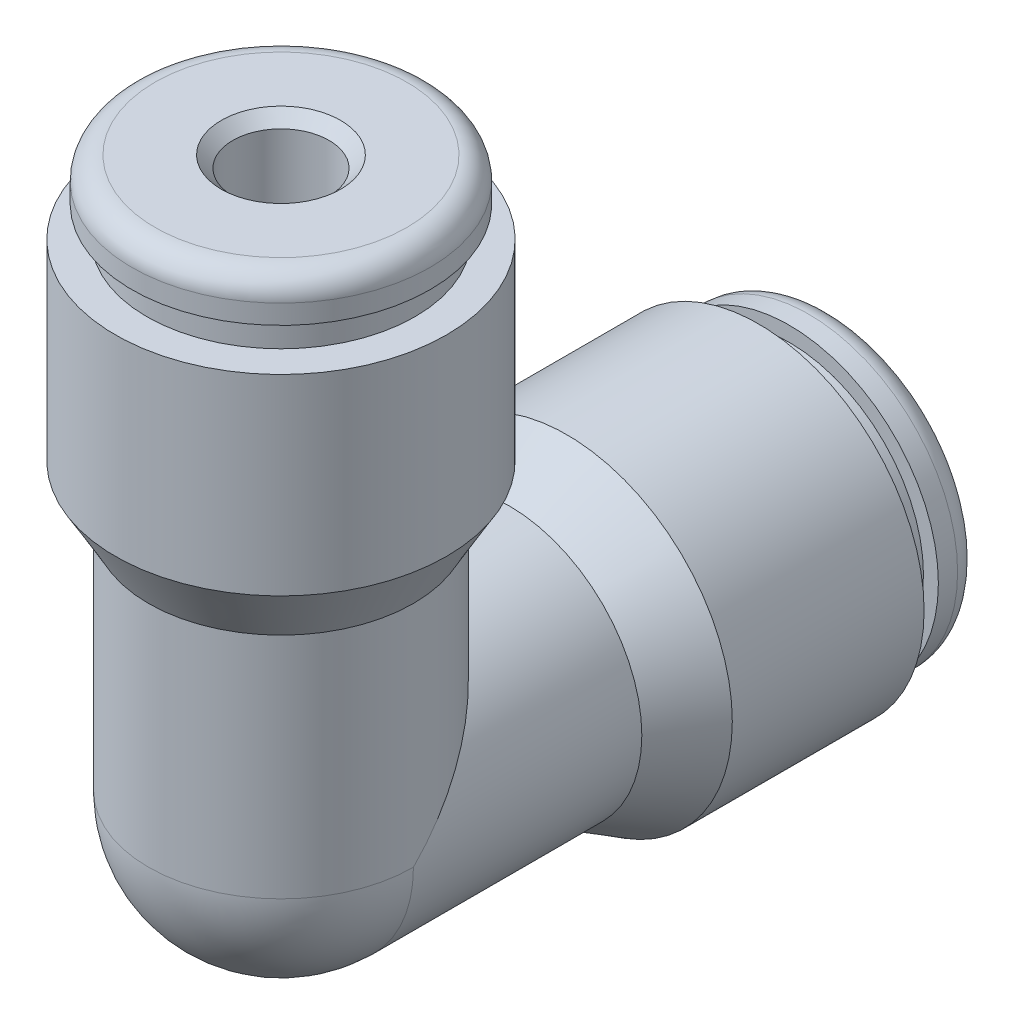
ISO-10303-21;
HEADER;
FILE_DESCRIPTION(('STEP AP214'),'2;1');
FILE_NAME('part.step','',(''),(''),'','','');
FILE_SCHEMA(('AUTOMOTIVE_DESIGN { 1 0 10303 214 1 1 1 1 }'));
ENDSEC;
DATA;
#1=APPLICATION_CONTEXT('core data for automotive mechanical design processes');
#2=APPLICATION_PROTOCOL_DEFINITION('international standard','automotive_design',2000,#1);
#3=PRODUCT_CONTEXT('',#1,'mechanical');
#4=PRODUCT('Part','Part','',(#3));
#5=PRODUCT_RELATED_PRODUCT_CATEGORY('part','',(#4));
#6=PRODUCT_DEFINITION_FORMATION('','',#4);
#7=PRODUCT_DEFINITION_CONTEXT('part definition',#1,'design');
#8=PRODUCT_DEFINITION('design','',#6,#7);
#9=PRODUCT_DEFINITION_SHAPE('','',#8);
#10=(LENGTH_UNIT() NAMED_UNIT(*) SI_UNIT(.MILLI.,.METRE.));
#11=(NAMED_UNIT(*) PLANE_ANGLE_UNIT() SI_UNIT($,.RADIAN.));
#12=(NAMED_UNIT(*) SI_UNIT($,.STERADIAN.) SOLID_ANGLE_UNIT());
#13=UNCERTAINTY_MEASURE_WITH_UNIT(LENGTH_MEASURE(1.E-05),#10,'distance_accuracy_value','');
#14=(GEOMETRIC_REPRESENTATION_CONTEXT(3) GLOBAL_UNCERTAINTY_ASSIGNED_CONTEXT((#13)) GLOBAL_UNIT_ASSIGNED_CONTEXT((#10,
#11,#12)) REPRESENTATION_CONTEXT('',''));
#15=CARTESIAN_POINT('',(0.,0.,0.));
#16=DIRECTION('',(0.,0.,1.));
#17=DIRECTION('',(1.,0.,0.));
#18=AXIS2_PLACEMENT_3D('',#15,#16,#17);
#19=CARTESIAN_POINT('',(0.,18.161,0.));
#20=DIRECTION('',(0.,-1.,0.));
#21=DIRECTION('',(0.,0.,-1.));
#22=AXIS2_PLACEMENT_3D('',#19,#20,#21);
#23=CYLINDRICAL_SURFACE('',#22,2.413);
#24=CARTESIAN_POINT('',(0.,0.,0.));
#25=DIRECTION('',(0.,-1.,0.));
#26=DIRECTION('',(1.,0.,0.));
#27=AXIS2_PLACEMENT_3D('',#24,#25,#26);
#28=CIRCLE('',#27,2.413);
#29=CARTESIAN_POINT('',(2.413,0.,0.));
#30=VERTEX_POINT('',#29);
#31=CARTESIAN_POINT('',(-2.413,0.,0.));
#32=VERTEX_POINT('',#31);
#33=EDGE_CURVE('E72',#30,#32,#28,.T.);
#34=ORIENTED_EDGE('',*,*,#33,.T.);
#35=CARTESIAN_POINT('',(0.,0.,0.));
#36=DIRECTION('',(0.,0.707106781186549,-0.707106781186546));
#37=DIRECTION('',(0.,0.707106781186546,0.707106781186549));
#38=AXIS2_PLACEMENT_3D('',#35,#36,#37);
#39=ELLIPSE('',#38,3.41249732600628,2.413);
#40=EDGE_CURVE('E67',#30,#32,#39,.F.);
#41=ORIENTED_EDGE('',*,*,#40,.F.);
#42=EDGE_LOOP('',(#34,#41));
#43=FACE_BOUND('',#42,.T.);
#44=ADVANCED_FACE('F36',(#43),#23,.F.);
#45=CARTESIAN_POINT('',(0.,0.,0.));
#46=DIRECTION('',(0.,0.,1.));
#47=DIRECTION('',(1.,0.,0.));
#48=AXIS2_PLACEMENT_3D('',#45,#46,#47);
#49=CYLINDRICAL_SURFACE('',#48,4.3688);
#50=CARTESIAN_POINT('',(0.,0.,-7.5311));
#51=DIRECTION('',(0.,0.,1.));
#52=DIRECTION('',(1.,0.,0.));
#53=AXIS2_PLACEMENT_3D('',#50,#51,#52);
#54=CIRCLE('',#53,4.3688);
#55=CARTESIAN_POINT('',(4.3688,0.,-7.5311));
#56=VERTEX_POINT('',#55);
#57=EDGE_CURVE('E145',#56,#56,#54,.T.);
#58=ORIENTED_EDGE('',*,*,#57,.T.);
#59=EDGE_LOOP('',(#58));
#60=FACE_BOUND('',#59,.T.);
#61=CARTESIAN_POINT('',(0.,0.,0.));
#62=DIRECTION('',(0.,0.707106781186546,0.707106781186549));
#63=DIRECTION('',(0.,-0.707106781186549,0.707106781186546));
#64=AXIS2_PLACEMENT_3D('',#61,#62,#63);
#65=ELLIPSE('',#64,6.17841621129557,4.3688);
#66=CARTESIAN_POINT('',(4.3688,0.,0.));
#67=VERTEX_POINT('',#66);
#68=CARTESIAN_POINT('',(-4.3688,0.,0.));
#69=VERTEX_POINT('',#68);
#70=EDGE_CURVE('E111',#67,#69,#65,.T.);
#71=ORIENTED_EDGE('',*,*,#70,.F.);
#72=CARTESIAN_POINT('',(0.,0.,0.));
#73=DIRECTION('',(0.,0.,1.));
#74=DIRECTION('',(1.,0.,0.));
#75=AXIS2_PLACEMENT_3D('',#72,#73,#74);
#76=CIRCLE('',#75,4.3688);
#77=EDGE_CURVE('E53',#69,#67,#76,.T.);
#78=ORIENTED_EDGE('',*,*,#77,.F.);
#79=EDGE_LOOP('',(#71,#78));
#80=FACE_BOUND('',#79,.T.);
#81=ADVANCED_FACE('F167',(#60,#80),#49,.T.);
#82=CARTESIAN_POINT('',(0.,0.,-4.3688));
#83=DIRECTION('',(0.,0.,1.));
#84=DIRECTION('',(1.,0.,0.));
#85=AXIS2_PLACEMENT_3D('',#82,#83,#84);
#86=CYLINDRICAL_SURFACE('',#85,2.413);
#87=CARTESIAN_POINT('',(0.,0.,0.));
#88=DIRECTION('',(0.,0.,1.));
#89=DIRECTION('',(1.,0.,0.));
#90=AXIS2_PLACEMENT_3D('',#87,#88,#89);
#91=CIRCLE('',#90,2.413);
#92=EDGE_CURVE('E62',#32,#30,#91,.T.);
#93=ORIENTED_EDGE('',*,*,#92,.T.);
#94=ORIENTED_EDGE('',*,*,#40,.T.);
#95=EDGE_LOOP('',(#93,#94));
#96=FACE_BOUND('',#95,.T.);
#97=CARTESIAN_POINT('',(0.,0.,-4.3688));
#98=DIRECTION('',(0.,0.,1.));
#99=DIRECTION('',(1.,0.,0.));
#100=AXIS2_PLACEMENT_3D('',#97,#98,#99);
#101=CIRCLE('',#100,2.413);
#102=CARTESIAN_POINT('',(2.413,0.,-4.3688));
#103=VERTEX_POINT('',#102);
#104=EDGE_CURVE('E70',#103,#103,#101,.T.);
#105=ORIENTED_EDGE('',*,*,#104,.F.);
#106=EDGE_LOOP('',(#105));
#107=FACE_BOUND('',#106,.T.);
#108=CARTESIAN_POINT('',(0.,2.413,0.825500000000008));
#109=CARTESIAN_POINT('',(-0.0449741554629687,2.41300030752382,0.825500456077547));
#110=CARTESIAN_POINT('',(-0.0899451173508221,2.41173117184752,0.821812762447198));
#111=CARTESIAN_POINT('',(-0.178558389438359,2.40679369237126,0.807207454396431));
#112=CARTESIAN_POINT('',(-0.222200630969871,2.40312522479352,0.7962894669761));
#113=CARTESIAN_POINT('',(-0.306866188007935,2.39378672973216,0.767644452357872));
#114=CARTESIAN_POINT('',(-0.347893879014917,2.38812015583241,0.749929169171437));
#115=CARTESIAN_POINT('',(-0.426395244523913,2.37536096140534,0.708246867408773));
#116=CARTESIAN_POINT('',(-0.463868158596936,2.36826803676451,0.684278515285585));
#117=CARTESIAN_POINT('',(-0.535554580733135,2.3531122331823,0.629858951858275));
#118=CARTESIAN_POINT('',(-0.569621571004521,2.34502523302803,0.5992214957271));
#119=CARTESIAN_POINT('',(-0.63224722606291,2.32892249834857,0.532729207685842));
#120=CARTESIAN_POINT('',(-0.66080458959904,2.32090678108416,0.49687314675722));
#121=CARTESIAN_POINT('',(-0.712455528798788,2.3055857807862,0.41961992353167));
#122=CARTESIAN_POINT('',(-0.735355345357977,2.29830971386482,0.378086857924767));
#123=CARTESIAN_POINT('',(-0.773781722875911,2.28566032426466,0.291469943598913));
#124=CARTESIAN_POINT('',(-0.789310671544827,2.28028638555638,0.246387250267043));
#125=CARTESIAN_POINT('',(-0.811998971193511,2.27230447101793,0.155621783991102));
#126=CARTESIAN_POINT('',(-0.819433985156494,2.26960569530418,0.110016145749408));
#127=CARTESIAN_POINT('',(-0.826585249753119,2.26701162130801,0.0181309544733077));
#128=CARTESIAN_POINT('',(-0.826304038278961,2.26711540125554,-0.0281483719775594));
#129=CARTESIAN_POINT('',(-0.818244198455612,2.2700353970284,-0.117683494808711));
#130=CARTESIAN_POINT('',(-0.810829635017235,2.27271989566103,-0.160977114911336));
#131=CARTESIAN_POINT('',(-0.789309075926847,2.28028264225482,-0.245664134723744));
#132=CARTESIAN_POINT('',(-0.775202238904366,2.28516116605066,-0.287057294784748));
#133=CARTESIAN_POINT('',(-0.740467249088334,2.29665310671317,-0.367578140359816));
#134=CARTESIAN_POINT('',(-0.719733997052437,2.30329416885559,-0.406656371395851));
#135=CARTESIAN_POINT('',(-0.67240770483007,2.3175518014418,-0.480892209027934));
#136=CARTESIAN_POINT('',(-0.645812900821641,2.32516866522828,-0.516048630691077));
#137=CARTESIAN_POINT('',(-0.585786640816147,2.3410333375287,-0.583482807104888));
#138=CARTESIAN_POINT('',(-0.552058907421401,2.34929276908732,-0.615494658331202));
#139=CARTESIAN_POINT('',(-0.47961314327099,2.36514556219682,-0.673479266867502));
#140=CARTESIAN_POINT('',(-0.440894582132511,2.37273885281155,-0.699451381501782));
#141=CARTESIAN_POINT('',(-0.358979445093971,2.38651294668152,-0.744848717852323));
#142=CARTESIAN_POINT('',(-0.315738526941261,2.39267739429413,-0.764199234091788));
#143=CARTESIAN_POINT('',(-0.226353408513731,2.40278007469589,-0.795267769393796));
#144=CARTESIAN_POINT('',(-0.18021027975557,2.40671912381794,-0.806988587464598));
#145=CARTESIAN_POINT('',(-0.0885790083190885,2.41179027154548,-0.82198591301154));
#146=CARTESIAN_POINT('',(-0.0431561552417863,2.41304162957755,-0.825621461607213));
#147=CARTESIAN_POINT('',(0.0476617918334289,2.41295626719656,-0.825372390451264));
#148=CARTESIAN_POINT('',(0.0930568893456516,2.4116200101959,-0.821489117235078));
#149=CARTESIAN_POINT('',(0.181070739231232,2.40658834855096,-0.806594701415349));
#150=CARTESIAN_POINT('',(0.223731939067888,2.40296691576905,-0.795806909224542));
#151=CARTESIAN_POINT('',(0.306619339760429,2.39380319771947,-0.767691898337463));
#152=CARTESIAN_POINT('',(0.346845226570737,2.38826066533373,-0.750363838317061));
#153=CARTESIAN_POINT('',(0.424934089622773,2.37562785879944,-0.709142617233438));
#154=CARTESIAN_POINT('',(0.462703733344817,2.36849977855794,-0.685084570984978));
#155=CARTESIAN_POINT('',(0.533784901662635,2.35350047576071,-0.6312783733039));
#156=CARTESIAN_POINT('',(0.567094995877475,2.34562901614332,-0.601528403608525));
#157=CARTESIAN_POINT('',(0.629976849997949,2.32954984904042,-0.535496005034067));
#158=CARTESIAN_POINT('',(0.659292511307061,2.32134413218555,-0.498968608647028));
#159=CARTESIAN_POINT('',(0.711413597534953,2.30590567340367,-0.421338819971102));
#160=CARTESIAN_POINT('',(0.734218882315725,2.29867295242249,-0.380236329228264));
#161=CARTESIAN_POINT('',(0.772586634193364,2.28606402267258,-0.294551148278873));
#162=CARTESIAN_POINT('',(0.78815645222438,2.28068593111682,-0.249972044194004));
#163=CARTESIAN_POINT('',(0.811491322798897,2.27248911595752,-0.15859618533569));
#164=CARTESIAN_POINT('',(0.819260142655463,2.26966915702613,-0.111800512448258));
#165=CARTESIAN_POINT('',(0.826469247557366,2.26705332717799,-0.0200410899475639));
#166=CARTESIAN_POINT('',(0.826336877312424,2.26710228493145,0.0248850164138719));
#167=CARTESIAN_POINT('',(0.818807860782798,2.2698322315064,0.114038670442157));
#168=CARTESIAN_POINT('',(0.811411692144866,2.27251304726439,0.158266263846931));
#169=CARTESIAN_POINT('',(0.789874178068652,2.28008617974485,0.243834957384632));
#170=CARTESIAN_POINT('',(0.775878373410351,2.28493066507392,0.285217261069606));
#171=CARTESIAN_POINT('',(0.741658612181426,2.29626541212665,0.365076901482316));
#172=CARTESIAN_POINT('',(0.721433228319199,2.30275605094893,0.403553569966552));
#173=CARTESIAN_POINT('',(0.674255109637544,2.31702003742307,0.478409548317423));
#174=CARTESIAN_POINT('',(0.647038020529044,2.32483832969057,0.514613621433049));
#175=CARTESIAN_POINT('',(0.587088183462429,2.3406957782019,0.582078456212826));
#176=CARTESIAN_POINT('',(0.55435383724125,2.34873499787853,0.613337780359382));
#177=CARTESIAN_POINT('',(0.482654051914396,2.3645327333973,0.671348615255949));
#178=CARTESIAN_POINT('',(0.443485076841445,2.37226539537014,0.697856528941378));
#179=CARTESIAN_POINT('',(0.360988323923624,2.38621109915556,0.743886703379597));
#180=CARTESIAN_POINT('',(0.317661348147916,2.39242443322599,0.763410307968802));
#181=CARTESIAN_POINT('',(0.229273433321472,2.40248327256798,0.794365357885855));
#182=CARTESIAN_POINT('',(0.184291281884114,2.40638837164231,0.806001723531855));
#183=CARTESIAN_POINT('',(0.0928713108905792,2.41164617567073,0.82156759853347));
#184=CARTESIAN_POINT('',(0.0464339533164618,2.41299968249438,0.825499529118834));
#185=CARTESIAN_POINT('',(0.,2.413,0.825500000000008));
#186=B_SPLINE_CURVE_WITH_KNOTS('',3,(#108,#109,#110,#111,#112,#113,#114,#115,#116,#117,#118,
#119,#120,#121,#122,#123,#124,#125,#126,#127,#128,#129,#130,#131,#132,#133,#134,#135,#136,#137,
#138,#139,#140,#141,#142,#143,#144,#145,#146,#147,#148,#149,#150,#151,#152,#153,#154,#155,#156,
#157,#158,#159,#160,#161,#162,#163,#164,#165,#166,#167,#168,#169,#170,#171,#172,#173,#174,#175,
#176,#177,#178,#179,#180,#181,#182,#183,#184,#185),.UNSPECIFIED.,.T.,.F.,(4,2,2,2,2,2,2,2,2,2,2,
2,2,2,2,2,2,2,2,2,2,2,2,2,2,2,2,2,2,2,2,2,2,2,2,2,2,2,4),(0.,0.134751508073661,
0.269509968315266,0.404036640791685,0.53859202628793,0.677544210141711,0.816529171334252,
0.959763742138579,1.10295188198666,1.24109401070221,1.37919070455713,1.51059376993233,
1.64201336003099,1.77563042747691,1.9092877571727,2.05032056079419,2.19136836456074,
2.33395871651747,2.47649672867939,2.61256683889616,2.74861258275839,2.88046575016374,
3.0123358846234,3.14777259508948,3.28325264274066,3.42523401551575,3.56721844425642,
3.70905830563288,3.85082963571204,3.98494043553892,4.1190424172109,4.25031627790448,
4.3816202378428,4.51890205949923,4.65622371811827,4.7992960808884,4.94234090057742,
5.08150999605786,5.22063534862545),.UNSPECIFIED.);
#187=CARTESIAN_POINT('',(0.,2.413,0.825500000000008));
#188=VERTEX_POINT('',#187);
#189=EDGE_CURVE('E80',#188,#188,#186,.T.);
#190=ORIENTED_EDGE('',*,*,#189,.F.);
#191=EDGE_LOOP('',(#190));
#192=FACE_BOUND('',#191,.T.);
#193=ADVANCED_FACE('F64',(#96,#107,#192),#86,.F.);
#194=CARTESIAN_POINT('',(0.,0.,0.));
#195=DIRECTION('',(0.,0.,1.));
#196=DIRECTION('',(1.,0.,0.));
#197=AXIS2_PLACEMENT_3D('',#194,#195,#196);
#198=CYLINDRICAL_SURFACE('',#197,3.175);
#199=CARTESIAN_POINT('',(0.,0.,-17.78));
#200=DIRECTION('',(0.,0.,1.));
#201=DIRECTION('',(1.,0.,0.));
#202=AXIS2_PLACEMENT_3D('',#199,#200,#201);
#203=CIRCLE('',#202,3.175);
#204=CARTESIAN_POINT('',(3.175,0.,-17.78));
#205=VERTEX_POINT('',#204);
#206=EDGE_CURVE('E117',#205,#205,#203,.T.);
#207=ORIENTED_EDGE('',*,*,#206,.F.);
#208=EDGE_LOOP('',(#207));
#209=FACE_BOUND('',#208,.T.);
#210=CARTESIAN_POINT('',(0.,0.,-4.3688));
#211=DIRECTION('',(0.,0.,1.));
#212=DIRECTION('',(1.,0.,0.));
#213=AXIS2_PLACEMENT_3D('',#210,#211,#212);
#214=CIRCLE('',#213,3.175);
#215=CARTESIAN_POINT('',(3.175,0.,-4.3688));
#216=VERTEX_POINT('',#215);
#217=EDGE_CURVE('E148',#216,#216,#214,.F.);
#218=ORIENTED_EDGE('',*,*,#217,.F.);
#219=EDGE_LOOP('',(#218));
#220=FACE_BOUND('',#219,.T.);
#221=ADVANCED_FACE('F179',(#209,#220),#198,.F.);
#222=CARTESIAN_POINT('',(0.,0.,-9.42284589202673));
#223=DIRECTION('',(0.,0.,-1.));
#224=DIRECTION('',(-1.,0.,0.));
#225=AXIS2_PLACEMENT_3D('',#222,#223,#224);
#226=CONICAL_SURFACE('',#225,5.461,0.5235987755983);
#227=ORIENTED_EDGE('',*,*,#57,.F.);
#228=EDGE_LOOP('',(#227));
#229=FACE_BOUND('',#228,.T.);
#230=CARTESIAN_POINT('',(0.,0.,-9.42284589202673));
#231=DIRECTION('',(0.,0.,1.));
#232=DIRECTION('',(1.,0.,0.));
#233=AXIS2_PLACEMENT_3D('',#230,#231,#232);
#234=CIRCLE('',#233,5.461);
#235=CARTESIAN_POINT('',(5.461,0.,-9.42284589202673));
#236=VERTEX_POINT('',#235);
#237=EDGE_CURVE('E142',#236,#236,#234,.T.);
#238=ORIENTED_EDGE('',*,*,#237,.T.);
#239=EDGE_LOOP('',(#238));
#240=FACE_BOUND('',#239,.T.);
#241=ADVANCED_FACE('F216',(#229,#240),#226,.T.);
#242=CARTESIAN_POINT('',(0.,0.,0.));
#243=DIRECTION('',(0.,0.,1.));
#244=DIRECTION('',(1.,0.,0.));
#245=AXIS2_PLACEMENT_3D('',#242,#243,#244);
#246=CYLINDRICAL_SURFACE('',#245,5.461);
#247=ORIENTED_EDGE('',*,*,#237,.F.);
#248=EDGE_LOOP('',(#247));
#249=FACE_BOUND('',#248,.T.);
#250=CARTESIAN_POINT('',(0.,0.,-15.748));
#251=DIRECTION('',(0.,0.,1.));
#252=DIRECTION('',(1.,0.,0.));
#253=AXIS2_PLACEMENT_3D('',#250,#251,#252);
#254=CIRCLE('',#253,5.461);
#255=CARTESIAN_POINT('',(5.461,0.,-15.748));
#256=VERTEX_POINT('',#255);
#257=EDGE_CURVE('E139',#256,#256,#254,.T.);
#258=ORIENTED_EDGE('',*,*,#257,.T.);
#259=EDGE_LOOP('',(#258));
#260=FACE_BOUND('',#259,.T.);
#261=ADVANCED_FACE('F212',(#249,#260),#246,.T.);
#262=CARTESIAN_POINT('',(0.,5.461,-15.748));
#263=DIRECTION('',(0.,0.,1.));
#264=DIRECTION('',(1.,0.,0.));
#265=AXIS2_PLACEMENT_3D('',#262,#263,#264);
#266=PLANE('',#265);
#267=ORIENTED_EDGE('',*,*,#257,.F.);
#268=EDGE_LOOP('',(#267));
#269=FACE_BOUND('',#268,.T.);
#270=CARTESIAN_POINT('',(0.,0.,-15.748));
#271=DIRECTION('',(0.,0.,1.));
#272=DIRECTION('',(1.,0.,0.));
#273=AXIS2_PLACEMENT_3D('',#270,#271,#272);
#274=CIRCLE('',#273,4.42341);
#275=CARTESIAN_POINT('',(4.42341,0.,-15.748));
#276=VERTEX_POINT('',#275);
#277=EDGE_CURVE('E136',#276,#276,#274,.T.);
#278=ORIENTED_EDGE('',*,*,#277,.T.);
#279=EDGE_LOOP('',(#278));
#280=FACE_BOUND('',#279,.T.);
#281=ADVANCED_FACE('F208',(#269,#280),#266,.F.);
#282=CARTESIAN_POINT('',(0.,0.,0.));
#283=DIRECTION('',(0.,0.,1.));
#284=DIRECTION('',(1.,0.,0.));
#285=AXIS2_PLACEMENT_3D('',#282,#283,#284);
#286=CYLINDRICAL_SURFACE('',#285,4.42341);
#287=ORIENTED_EDGE('',*,*,#277,.F.);
#288=EDGE_LOOP('',(#287));
#289=FACE_BOUND('',#288,.T.);
#290=CARTESIAN_POINT('',(0.,0.,-16.764));
#291=DIRECTION('',(0.,0.,1.));
#292=DIRECTION('',(1.,0.,0.));
#293=AXIS2_PLACEMENT_3D('',#290,#291,#292);
#294=CIRCLE('',#293,4.42341);
#295=CARTESIAN_POINT('',(4.42341,0.,-16.764));
#296=VERTEX_POINT('',#295);
#297=EDGE_CURVE('E133',#296,#296,#294,.T.);
#298=ORIENTED_EDGE('',*,*,#297,.T.);
#299=EDGE_LOOP('',(#298));
#300=FACE_BOUND('',#299,.T.);
#301=ADVANCED_FACE('F204',(#289,#300),#286,.T.);
#302=CARTESIAN_POINT('',(0.,4.9149,-16.764));
#303=DIRECTION('',(0.,0.,-1.));
#304=DIRECTION('',(-1.,0.,0.));
#305=AXIS2_PLACEMENT_3D('',#302,#303,#304);
#306=PLANE('',#305);
#307=ORIENTED_EDGE('',*,*,#297,.F.);
#308=EDGE_LOOP('',(#307));
#309=FACE_BOUND('',#308,.T.);
#310=CARTESIAN_POINT('',(0.,0.,-16.764));
#311=DIRECTION('',(0.,0.,1.));
#312=DIRECTION('',(1.,0.,0.));
#313=AXIS2_PLACEMENT_3D('',#310,#311,#312);
#314=CIRCLE('',#313,4.9149);
#315=CARTESIAN_POINT('',(4.9149,0.,-16.764));
#316=VERTEX_POINT('',#315);
#317=EDGE_CURVE('E130',#316,#316,#314,.T.);
#318=ORIENTED_EDGE('',*,*,#317,.T.);
#319=EDGE_LOOP('',(#318));
#320=FACE_BOUND('',#319,.T.);
#321=ADVANCED_FACE('F200',(#309,#320),#306,.F.);
#322=CARTESIAN_POINT('',(0.,0.,0.));
#323=DIRECTION('',(0.,0.,1.));
#324=DIRECTION('',(1.,0.,0.));
#325=AXIS2_PLACEMENT_3D('',#322,#323,#324);
#326=CYLINDRICAL_SURFACE('',#325,4.9149);
#327=ORIENTED_EDGE('',*,*,#317,.F.);
#328=EDGE_LOOP('',(#327));
#329=FACE_BOUND('',#328,.T.);
#330=CARTESIAN_POINT('',(0.,0.,-17.399));
#331=DIRECTION('',(0.,0.,1.));
#332=DIRECTION('',(1.,0.,0.));
#333=AXIS2_PLACEMENT_3D('',#330,#331,#332);
#334=CIRCLE('',#333,4.9149);
#335=CARTESIAN_POINT('',(4.9149,0.,-17.399));
#336=VERTEX_POINT('',#335);
#337=EDGE_CURVE('E127',#336,#336,#334,.T.);
#338=ORIENTED_EDGE('',*,*,#337,.T.);
#339=EDGE_LOOP('',(#338));
#340=FACE_BOUND('',#339,.T.);
#341=ADVANCED_FACE('F196',(#329,#340),#326,.T.);
#342=CARTESIAN_POINT('',(0.,0.,-17.399));
#343=DIRECTION('',(0.,0.,1.));
#344=DIRECTION('',(1.,0.,0.));
#345=AXIS2_PLACEMENT_3D('',#342,#343,#344);
#346=TOROIDAL_SURFACE('',#345,4.1529,0.762);
#347=ORIENTED_EDGE('',*,*,#337,.F.);
#348=EDGE_LOOP('',(#347));
#349=FACE_BOUND('',#348,.T.);
#350=CARTESIAN_POINT('',(0.,0.,-18.161));
#351=DIRECTION('',(0.,0.,1.));
#352=DIRECTION('',(1.,0.,0.));
#353=AXIS2_PLACEMENT_3D('',#350,#351,#352);
#354=CIRCLE('',#353,4.1529);
#355=CARTESIAN_POINT('',(4.1529,0.,-18.161));
#356=VERTEX_POINT('',#355);
#357=EDGE_CURVE('E124',#356,#356,#354,.T.);
#358=ORIENTED_EDGE('',*,*,#357,.T.);
#359=EDGE_LOOP('',(#358));
#360=FACE_BOUND('',#359,.T.);
#361=ADVANCED_FACE('F192',(#349,#360),#346,.T.);
#362=CARTESIAN_POINT('',(0.,4.1529,-18.161));
#363=DIRECTION('',(0.,0.,1.));
#364=DIRECTION('',(1.,0.,0.));
#365=AXIS2_PLACEMENT_3D('',#362,#363,#364);
#366=PLANE('',#365);
#367=ORIENTED_EDGE('',*,*,#357,.F.);
#368=EDGE_LOOP('',(#367));
#369=FACE_BOUND('',#368,.T.);
#370=CARTESIAN_POINT('',(0.,0.,-18.161));
#371=DIRECTION('',(0.,0.,1.));
#372=DIRECTION('',(1.,0.,0.));
#373=AXIS2_PLACEMENT_3D('',#370,#371,#372);
#374=CIRCLE('',#373,3.556);
#375=CARTESIAN_POINT('',(3.556,0.,-18.161));
#376=VERTEX_POINT('',#375);
#377=EDGE_CURVE('E121',#376,#376,#374,.T.);
#378=ORIENTED_EDGE('',*,*,#377,.T.);
#379=EDGE_LOOP('',(#378));
#380=FACE_BOUND('',#379,.T.);
#381=ADVANCED_FACE('F188',(#369,#380),#366,.F.);
#382=CARTESIAN_POINT('',(0.,0.,-17.78));
#383=DIRECTION('',(0.,0.,-1.));
#384=DIRECTION('',(-1.,0.,0.));
#385=AXIS2_PLACEMENT_3D('',#382,#383,#384);
#386=CONICAL_SURFACE('',#385,3.175,0.785398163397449);
#387=ORIENTED_EDGE('',*,*,#377,.F.);
#388=EDGE_LOOP('',(#387));
#389=FACE_BOUND('',#388,.T.);
#390=ORIENTED_EDGE('',*,*,#206,.T.);
#391=EDGE_LOOP('',(#390));
#392=FACE_BOUND('',#391,.T.);
#393=ADVANCED_FACE('F184',(#389,#392),#386,.F.);
#394=CARTESIAN_POINT('',(0.,0.,-4.3688));
#395=DIRECTION('',(0.,0.,1.));
#396=DIRECTION('',(1.,0.,0.));
#397=AXIS2_PLACEMENT_3D('',#394,#395,#396);
#398=PLANE('',#397);
#399=ORIENTED_EDGE('',*,*,#217,.T.);
#400=EDGE_LOOP('',(#399));
#401=FACE_BOUND('',#400,.T.);
#402=ORIENTED_EDGE('',*,*,#104,.T.);
#403=EDGE_LOOP('',(#402));
#404=FACE_BOUND('',#403,.T.);
#405=ADVANCED_FACE('F180',(#401,#404),#398,.F.);
#406=CARTESIAN_POINT('',(0.,0.,0.));
#407=DIRECTION('',(1.,0.,0.));
#408=DIRECTION('',(0.,0.,-1.));
#409=AXIS2_PLACEMENT_3D('',#406,#407,#408);
#410=SPHERICAL_SURFACE('',#409,4.3688);
#411=ORIENTED_EDGE('',*,*,#77,.T.);
#412=CARTESIAN_POINT('',(0.,0.,0.));
#413=DIRECTION('',(0.,1.,0.));
#414=DIRECTION('',(1.,0.,0.));
#415=AXIS2_PLACEMENT_3D('',#412,#413,#414);
#416=CIRCLE('',#415,4.3688);
#417=EDGE_CURVE('E50',#69,#67,#416,.T.);
#418=ORIENTED_EDGE('',*,*,#417,.F.);
#419=EDGE_LOOP('',(#411,#418));
#420=FACE_BOUND('',#419,.T.);
#421=ADVANCED_FACE('F183',(#420),#410,.T.);
#422=CARTESIAN_POINT('',(0.,0.,0.));
#423=DIRECTION('',(1.,0.,0.));
#424=DIRECTION('',(0.,0.,1.));
#425=AXIS2_PLACEMENT_3D('',#422,#423,#424);
#426=SPHERICAL_SURFACE('',#425,2.413);
#427=ORIENTED_EDGE('',*,*,#92,.F.);
#428=ORIENTED_EDGE('',*,*,#33,.F.);
#429=EDGE_LOOP('',(#427,#428));
#430=FACE_BOUND('',#429,.T.);
#431=ADVANCED_FACE('F73',(#430),#426,.F.);
#432=CARTESIAN_POINT('',(0.,0.,0.));
#433=DIRECTION('',(0.,-1.,0.));
#434=DIRECTION('',(1.,0.,0.));
#435=AXIS2_PLACEMENT_3D('',#432,#433,#434);
#436=CYLINDRICAL_SURFACE('',#435,4.3688);
#437=CARTESIAN_POINT('',(0.,7.5311,0.));
#438=DIRECTION('',(0.,-1.,0.));
#439=DIRECTION('',(1.,0.,0.));
#440=AXIS2_PLACEMENT_3D('',#437,#438,#439);
#441=CIRCLE('',#440,4.3688);
#442=CARTESIAN_POINT('',(4.3688,7.5311,0.));
#443=VERTEX_POINT('',#442);
#444=EDGE_CURVE('E108',#443,#443,#441,.T.);
#445=ORIENTED_EDGE('',*,*,#444,.T.);
#446=EDGE_LOOP('',(#445));
#447=FACE_BOUND('',#446,.T.);
#448=ORIENTED_EDGE('',*,*,#417,.T.);
#449=ORIENTED_EDGE('',*,*,#70,.T.);
#450=EDGE_LOOP('',(#448,#449));
#451=FACE_BOUND('',#450,.T.);
#452=ADVANCED_FACE('F279',(#447,#451),#436,.T.);
#453=CARTESIAN_POINT('',(0.,9.42284589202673,0.));
#454=DIRECTION('',(0.,1.,0.));
#455=DIRECTION('',(-1.,0.,0.));
#456=AXIS2_PLACEMENT_3D('',#453,#454,#455);
#457=CONICAL_SURFACE('',#456,5.461,0.5235987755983);
#458=ORIENTED_EDGE('',*,*,#444,.F.);
#459=EDGE_LOOP('',(#458));
#460=FACE_BOUND('',#459,.T.);
#461=CARTESIAN_POINT('',(0.,9.42284589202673,0.));
#462=DIRECTION('',(0.,-1.,0.));
#463=DIRECTION('',(1.,0.,0.));
#464=AXIS2_PLACEMENT_3D('',#461,#462,#463);
#465=CIRCLE('',#464,5.461);
#466=CARTESIAN_POINT('',(5.461,9.42284589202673,0.));
#467=VERTEX_POINT('',#466);
#468=EDGE_CURVE('E105',#467,#467,#465,.T.);
#469=ORIENTED_EDGE('',*,*,#468,.T.);
#470=EDGE_LOOP('',(#469));
#471=FACE_BOUND('',#470,.T.);
#472=ADVANCED_FACE('F275',(#460,#471),#457,.T.);
#473=CARTESIAN_POINT('',(0.,0.,0.));
#474=DIRECTION('',(0.,-1.,0.));
#475=DIRECTION('',(1.,0.,0.));
#476=AXIS2_PLACEMENT_3D('',#473,#474,#475);
#477=CYLINDRICAL_SURFACE('',#476,5.461);
#478=ORIENTED_EDGE('',*,*,#468,.F.);
#479=EDGE_LOOP('',(#478));
#480=FACE_BOUND('',#479,.T.);
#481=CARTESIAN_POINT('',(0.,15.748,0.));
#482=DIRECTION('',(0.,-1.,0.));
#483=DIRECTION('',(1.,0.,0.));
#484=AXIS2_PLACEMENT_3D('',#481,#482,#483);
#485=CIRCLE('',#484,5.461);
#486=CARTESIAN_POINT('',(5.461,15.748,0.));
#487=VERTEX_POINT('',#486);
#488=EDGE_CURVE('E102',#487,#487,#485,.T.);
#489=ORIENTED_EDGE('',*,*,#488,.T.);
#490=EDGE_LOOP('',(#489));
#491=FACE_BOUND('',#490,.T.);
#492=ADVANCED_FACE('F271',(#480,#491),#477,.T.);
#493=CARTESIAN_POINT('',(0.,15.748,5.46100000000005));
#494=DIRECTION('',(0.,-1.,0.));
#495=DIRECTION('',(1.,0.,0.));
#496=AXIS2_PLACEMENT_3D('',#493,#494,#495);
#497=PLANE('',#496);
#498=ORIENTED_EDGE('',*,*,#488,.F.);
#499=EDGE_LOOP('',(#498));
#500=FACE_BOUND('',#499,.T.);
#501=CARTESIAN_POINT('',(0.,15.748,0.));
#502=DIRECTION('',(0.,-1.,0.));
#503=DIRECTION('',(1.,0.,0.));
#504=AXIS2_PLACEMENT_3D('',#501,#502,#503);
#505=CIRCLE('',#504,4.42341);
#506=CARTESIAN_POINT('',(4.42341,15.748,0.));
#507=VERTEX_POINT('',#506);
#508=EDGE_CURVE('E99',#507,#507,#505,.T.);
#509=ORIENTED_EDGE('',*,*,#508,.T.);
#510=EDGE_LOOP('',(#509));
#511=FACE_BOUND('',#510,.T.);
#512=ADVANCED_FACE('F267',(#500,#511),#497,.F.);
#513=CARTESIAN_POINT('',(0.,0.,0.));
#514=DIRECTION('',(0.,-1.,0.));
#515=DIRECTION('',(1.,0.,0.));
#516=AXIS2_PLACEMENT_3D('',#513,#514,#515);
#517=CYLINDRICAL_SURFACE('',#516,4.42341);
#518=ORIENTED_EDGE('',*,*,#508,.F.);
#519=EDGE_LOOP('',(#518));
#520=FACE_BOUND('',#519,.T.);
#521=CARTESIAN_POINT('',(0.,16.764,0.));
#522=DIRECTION('',(0.,-1.,0.));
#523=DIRECTION('',(1.,0.,0.));
#524=AXIS2_PLACEMENT_3D('',#521,#522,#523);
#525=CIRCLE('',#524,4.42341);
#526=CARTESIAN_POINT('',(4.42341,16.764,0.));
#527=VERTEX_POINT('',#526);
#528=EDGE_CURVE('E96',#527,#527,#525,.T.);
#529=ORIENTED_EDGE('',*,*,#528,.T.);
#530=EDGE_LOOP('',(#529));
#531=FACE_BOUND('',#530,.T.);
#532=ADVANCED_FACE('F263',(#520,#531),#517,.T.);
#533=CARTESIAN_POINT('',(0.,16.764,4.91490000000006));
#534=DIRECTION('',(0.,1.,0.));
#535=DIRECTION('',(-1.,0.,0.));
#536=AXIS2_PLACEMENT_3D('',#533,#534,#535);
#537=PLANE('',#536);
#538=ORIENTED_EDGE('',*,*,#528,.F.);
#539=EDGE_LOOP('',(#538));
#540=FACE_BOUND('',#539,.T.);
#541=CARTESIAN_POINT('',(0.,16.764,0.));
#542=DIRECTION('',(0.,-1.,0.));
#543=DIRECTION('',(1.,0.,0.));
#544=AXIS2_PLACEMENT_3D('',#541,#542,#543);
#545=CIRCLE('',#544,4.9149);
#546=CARTESIAN_POINT('',(4.9149,16.764,0.));
#547=VERTEX_POINT('',#546);
#548=EDGE_CURVE('E93',#547,#547,#545,.T.);
#549=ORIENTED_EDGE('',*,*,#548,.T.);
#550=EDGE_LOOP('',(#549));
#551=FACE_BOUND('',#550,.T.);
#552=ADVANCED_FACE('F259',(#540,#551),#537,.F.);
#553=CARTESIAN_POINT('',(0.,0.,0.));
#554=DIRECTION('',(0.,-1.,0.));
#555=DIRECTION('',(1.,0.,0.));
#556=AXIS2_PLACEMENT_3D('',#553,#554,#555);
#557=CYLINDRICAL_SURFACE('',#556,4.9149);
#558=ORIENTED_EDGE('',*,*,#548,.F.);
#559=EDGE_LOOP('',(#558));
#560=FACE_BOUND('',#559,.T.);
#561=CARTESIAN_POINT('',(0.,17.399,0.));
#562=DIRECTION('',(0.,-1.,0.));
#563=DIRECTION('',(1.,0.,0.));
#564=AXIS2_PLACEMENT_3D('',#561,#562,#563);
#565=CIRCLE('',#564,4.9149);
#566=CARTESIAN_POINT('',(4.9149,17.399,0.));
#567=VERTEX_POINT('',#566);
#568=EDGE_CURVE('E90',#567,#567,#565,.T.);
#569=ORIENTED_EDGE('',*,*,#568,.T.);
#570=EDGE_LOOP('',(#569));
#571=FACE_BOUND('',#570,.T.);
#572=ADVANCED_FACE('F255',(#560,#571),#557,.T.);
#573=CARTESIAN_POINT('',(0.,17.399,0.));
#574=DIRECTION('',(0.,-1.,0.));
#575=DIRECTION('',(1.,0.,0.));
#576=AXIS2_PLACEMENT_3D('',#573,#574,#575);
#577=TOROIDAL_SURFACE('',#576,4.1529,0.762);
#578=ORIENTED_EDGE('',*,*,#568,.F.);
#579=EDGE_LOOP('',(#578));
#580=FACE_BOUND('',#579,.T.);
#581=CARTESIAN_POINT('',(0.,18.161,0.));
#582=DIRECTION('',(0.,-1.,0.));
#583=DIRECTION('',(1.,0.,0.));
#584=AXIS2_PLACEMENT_3D('',#581,#582,#583);
#585=CIRCLE('',#584,4.1529);
#586=CARTESIAN_POINT('',(4.1529,18.161,0.));
#587=VERTEX_POINT('',#586);
#588=EDGE_CURVE('E75',#587,#587,#585,.T.);
#589=ORIENTED_EDGE('',*,*,#588,.T.);
#590=EDGE_LOOP('',(#589));
#591=FACE_BOUND('',#590,.T.);
#592=ADVANCED_FACE('F252',(#580,#591),#577,.T.);
#593=CARTESIAN_POINT('',(0.,18.161,4.15290000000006));
#594=DIRECTION('',(0.,-1.,0.));
#595=DIRECTION('',(1.,0.,0.));
#596=AXIS2_PLACEMENT_3D('',#593,#594,#595);
#597=PLANE('',#596);
#598=CARTESIAN_POINT('',(0.,18.161,0.));
#599=DIRECTION('',(0.,-1.,0.));
#600=DIRECTION('',(0.,0.,-1.));
#601=AXIS2_PLACEMENT_3D('',#598,#599,#600);
#602=CIRCLE('',#601,1.96850000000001);
#603=CARTESIAN_POINT('',(0.,18.161,1.96850000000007));
#604=VERTEX_POINT('',#603);
#605=EDGE_CURVE('E44',#604,#604,#602,.T.);
#606=ORIENTED_EDGE('',*,*,#605,.T.);
#607=EDGE_LOOP('',(#606));
#608=FACE_BOUND('',#607,.T.);
#609=ORIENTED_EDGE('',*,*,#588,.F.);
#610=EDGE_LOOP('',(#609));
#611=FACE_BOUND('',#610,.T.);
#612=ADVANCED_FACE('F153',(#608,#611),#597,.F.);
#613=CARTESIAN_POINT('',(0.,4.3688,0.));
#614=DIRECTION('',(0.,-1.,0.));
#615=DIRECTION('',(1.,0.,0.));
#616=AXIS2_PLACEMENT_3D('',#613,#614,#615);
#617=PLANE('',#616);
#618=CARTESIAN_POINT('',(0.,4.3688,0.));
#619=DIRECTION('',(0.,1.,0.));
#620=DIRECTION('',(0.,0.,1.));
#621=AXIS2_PLACEMENT_3D('',#618,#619,#620);
#622=CIRCLE('',#621,1.5875);
#623=CARTESIAN_POINT('',(0.,4.36879999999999,1.58750000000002));
#624=VERTEX_POINT('',#623);
#625=EDGE_CURVE('E233',#624,#624,#622,.T.);
#626=ORIENTED_EDGE('',*,*,#625,.T.);
#627=EDGE_LOOP('',(#626));
#628=FACE_BOUND('',#627,.T.);
#629=CARTESIAN_POINT('',(0.,4.3688,0.));
#630=DIRECTION('',(0.,1.,0.));
#631=DIRECTION('',(0.,0.,1.));
#632=AXIS2_PLACEMENT_3D('',#629,#630,#631);
#633=CIRCLE('',#632,0.8255);
#634=CARTESIAN_POINT('',(0.,4.3688,0.825500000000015));
#635=VERTEX_POINT('',#634);
#636=EDGE_CURVE('E77',#635,#635,#633,.T.);
#637=ORIENTED_EDGE('',*,*,#636,.F.);
#638=EDGE_LOOP('',(#637));
#639=FACE_BOUND('',#638,.T.);
#640=ADVANCED_FACE('F238',(#628,#639),#617,.F.);
#641=CARTESIAN_POINT('',(0.,-5.46200000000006,0.));
#642=DIRECTION('',(0.,1.,0.));
#643=DIRECTION('',(0.,0.,1.));
#644=AXIS2_PLACEMENT_3D('',#641,#642,#643);
#645=CYLINDRICAL_SURFACE('',#644,0.8255);
#646=ORIENTED_EDGE('',*,*,#189,.T.);
#647=EDGE_LOOP('',(#646));
#648=FACE_BOUND('',#647,.T.);
#649=ORIENTED_EDGE('',*,*,#636,.T.);
#650=EDGE_LOOP('',(#649));
#651=FACE_BOUND('',#650,.T.);
#652=ADVANCED_FACE('F162',(#648,#651),#645,.F.);
#653=CARTESIAN_POINT('',(0.,28.2188868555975,0.));
#654=DIRECTION('',(0.,-1.,0.));
#655=DIRECTION('',(0.,0.,-1.));
#656=AXIS2_PLACEMENT_3D('',#653,#654,#655);
#657=CYLINDRICAL_SURFACE('',#656,1.5875);
#658=CARTESIAN_POINT('',(0.,17.78,0.));
#659=DIRECTION('',(0.,-1.,0.));
#660=DIRECTION('',(0.,0.,-1.));
#661=AXIS2_PLACEMENT_3D('',#658,#659,#660);
#662=CIRCLE('',#661,1.5875);
#663=CARTESIAN_POINT('',(0.,17.78,1.58750000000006));
#664=VERTEX_POINT('',#663);
#665=EDGE_CURVE('E11',#664,#664,#662,.F.);
#666=ORIENTED_EDGE('',*,*,#665,.T.);
#667=EDGE_LOOP('',(#666));
#668=FACE_BOUND('',#667,.T.);
#669=ORIENTED_EDGE('',*,*,#625,.F.);
#670=EDGE_LOOP('',(#669));
#671=FACE_BOUND('',#670,.T.);
#672=ADVANCED_FACE('F157',(#668,#671),#657,.F.);
#673=CARTESIAN_POINT('',(0.,18.161,0.));
#674=DIRECTION('',(0.,1.,0.));
#675=DIRECTION('',(0.,0.,1.));
#676=AXIS2_PLACEMENT_3D('',#673,#674,#675);
#677=CONICAL_SURFACE('',#676,1.96850000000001,0.785398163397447);
#678=CARTESIAN_POINT('',(0.,17.78,1.58750000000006));
#679=CARTESIAN_POINT('',(0.,17.78396875,1.59146875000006));
#680=CARTESIAN_POINT('',(0.,17.7879375,1.59543750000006));
#681=CARTESIAN_POINT('',(0.,17.795875,1.60337500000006));
#682=CARTESIAN_POINT('',(0.,17.79984375,1.60734375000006));
#683=CARTESIAN_POINT('',(0.,17.80778125,1.61528125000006));
#684=CARTESIAN_POINT('',(0.,17.81175,1.61925000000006));
#685=CARTESIAN_POINT('',(0.,17.8196875,1.62718750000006));
#686=CARTESIAN_POINT('',(0.,17.82365625,1.63115625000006));
#687=CARTESIAN_POINT('',(0.,17.83159375,1.63909375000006));
#688=CARTESIAN_POINT('',(0.,17.8355625,1.64306250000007));
#689=CARTESIAN_POINT('',(0.,17.8435,1.65100000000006));
#690=CARTESIAN_POINT('',(0.,17.84746875,1.65496875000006));
#691=CARTESIAN_POINT('',(0.,17.85540625,1.66290625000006));
#692=CARTESIAN_POINT('',(0.,17.859375,1.66687500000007));
#693=CARTESIAN_POINT('',(0.,17.8673125,1.67481250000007));
#694=CARTESIAN_POINT('',(0.,17.87128125,1.67878125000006));
#695=CARTESIAN_POINT('',(0.,17.87921875,1.68671875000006));
#696=CARTESIAN_POINT('',(0.,17.8831875,1.69068750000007));
#697=CARTESIAN_POINT('',(0.,17.891125,1.69862500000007));
#698=CARTESIAN_POINT('',(0.,17.89509375,1.70259375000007));
#699=CARTESIAN_POINT('',(0.,17.90303125,1.71053125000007));
#700=CARTESIAN_POINT('',(0.,17.907,1.71450000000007));
#701=CARTESIAN_POINT('',(0.,17.9149375,1.72243750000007));
#702=CARTESIAN_POINT('',(0.,17.91890625,1.72640625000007));
#703=CARTESIAN_POINT('',(0.,17.92684375,1.73434375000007));
#704=CARTESIAN_POINT('',(0.,17.9308125,1.73831250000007));
#705=CARTESIAN_POINT('',(0.,17.93875,1.74625000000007));
#706=CARTESIAN_POINT('',(0.,17.94271875,1.75021875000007));
#707=CARTESIAN_POINT('',(0.,17.95065625,1.75815625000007));
#708=CARTESIAN_POINT('',(0.,17.954625,1.76212500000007));
#709=CARTESIAN_POINT('',(0.,17.9625625,1.77006250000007));
#710=CARTESIAN_POINT('',(0.,17.96653125,1.77403125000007));
#711=CARTESIAN_POINT('',(0.,17.97446875,1.78196875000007));
#712=CARTESIAN_POINT('',(0.,17.9784375,1.78593750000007));
#713=CARTESIAN_POINT('',(0.,17.986375,1.79387500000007));
#714=CARTESIAN_POINT('',(0.,17.99034375,1.79784375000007));
#715=CARTESIAN_POINT('',(0.,17.99828125,1.80578125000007));
#716=CARTESIAN_POINT('',(0.,18.00225,1.80975000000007));
#717=CARTESIAN_POINT('',(0.,18.0101875,1.81768750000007));
#718=CARTESIAN_POINT('',(0.,18.01415625,1.82165625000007));
#719=CARTESIAN_POINT('',(0.,18.02209375,1.82959375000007));
#720=CARTESIAN_POINT('',(0.,18.0260625,1.83356250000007));
#721=CARTESIAN_POINT('',(0.,18.034,1.84150000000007));
#722=CARTESIAN_POINT('',(0.,18.03796875,1.84546875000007));
#723=CARTESIAN_POINT('',(0.,18.04590625,1.85340625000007));
#724=CARTESIAN_POINT('',(0.,18.049875,1.85737500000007));
#725=CARTESIAN_POINT('',(0.,18.0578125,1.86531250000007));
#726=CARTESIAN_POINT('',(0.,18.06178125,1.86928125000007));
#727=CARTESIAN_POINT('',(0.,18.06971875,1.87721875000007));
#728=CARTESIAN_POINT('',(0.,18.0736875,1.88118750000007));
#729=CARTESIAN_POINT('',(0.,18.081625,1.88912500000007));
#730=CARTESIAN_POINT('',(0.,18.08559375,1.89309375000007));
#731=CARTESIAN_POINT('',(0.,18.09353125,1.90103125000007));
#732=CARTESIAN_POINT('',(0.,18.0975,1.90500000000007));
#733=CARTESIAN_POINT('',(0.,18.1054375,1.91293750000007));
#734=CARTESIAN_POINT('',(0.,18.10940625,1.91690625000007));
#735=CARTESIAN_POINT('',(0.,18.11734375,1.92484375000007));
#736=CARTESIAN_POINT('',(0.,18.1213125,1.92881250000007));
#737=CARTESIAN_POINT('',(0.,18.12925,1.93675000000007));
#738=CARTESIAN_POINT('',(0.,18.13321875,1.94071875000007));
#739=CARTESIAN_POINT('',(0.,18.14115625,1.94865625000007));
#740=CARTESIAN_POINT('',(0.,18.145125,1.95262500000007));
#741=CARTESIAN_POINT('',(0.,18.1530625,1.96056250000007));
#742=CARTESIAN_POINT('',(0.,18.15703125,1.96453125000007));
#743=CARTESIAN_POINT('',(0.,18.161,1.96850000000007));
#744=B_SPLINE_CURVE_WITH_KNOTS('',3,(#678,#679,#680,#681,#682,#683,#684,#685,#686,#687,#688,
#689,#690,#691,#692,#693,#694,#695,#696,#697,#698,#699,#700,#701,#702,#703,#704,#705,#706,#707,
#708,#709,#710,#711,#712,#713,#714,#715,#716,#717,#718,#719,#720,#721,#722,#723,#724,#725,#726,
#727,#728,#729,#730,#731,#732,#733,#734,#735,#736,#737,#738,#739,#740,#741,#742,#743),
.UNSPECIFIED.,.F.,.F.,(4,2,2,2,2,2,2,2,2,2,2,2,2,2,2,2,2,2,2,2,2,2,2,2,2,2,2,2,2,2,2,2,4),(0.,
0.016837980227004,0.033675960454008,0.0505139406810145,0.0673519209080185,0.0841899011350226,
0.101027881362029,0.117865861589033,0.134703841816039,0.151541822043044,0.168379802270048,
0.185217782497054,0.202055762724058,0.218893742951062,0.235731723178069,0.252569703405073,
0.269407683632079,0.286245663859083,0.303083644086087,0.319921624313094,0.336759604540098,
0.353597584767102,0.370435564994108,0.387273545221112,0.404111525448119,0.420949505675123,
0.437787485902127,0.454625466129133,0.471463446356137,0.488301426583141,0.505139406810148,
0.521977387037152,0.538815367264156),.UNSPECIFIED.);
#745=EDGE_CURVE('BSEAM38',#664,#604,#744,.T.);
#746=ORIENTED_EDGE('',*,*,#665,.F.);
#747=ORIENTED_EDGE('',*,*,#605,.F.);
#748=ORIENTED_EDGE('',*,*,#745,.T.);
#749=ORIENTED_EDGE('',*,*,#745,.F.);
#750=EDGE_LOOP('',(#746,#748,#747,#749));
#751=FACE_BOUND('',#750,.T.);
#752=ADVANCED_FACE('F38',(#751),#677,.F.);
#753=CLOSED_SHELL('',(#44,#81,#193,#221,#241,#261,#281,#301,#321,#341,#361,#381,#393,#405,#421,
#431,#452,#472,#492,#512,#532,#552,#572,#592,#612,#640,#652,#672,#752));
#754=MANIFOLD_SOLID_BREP('B2',#753);
#755=ADVANCED_BREP_SHAPE_REPRESENTATION('',(#18,#754),#14);
#756=SHAPE_DEFINITION_REPRESENTATION(#9,#755);
ENDSEC;
END-ISO-10303-21;
